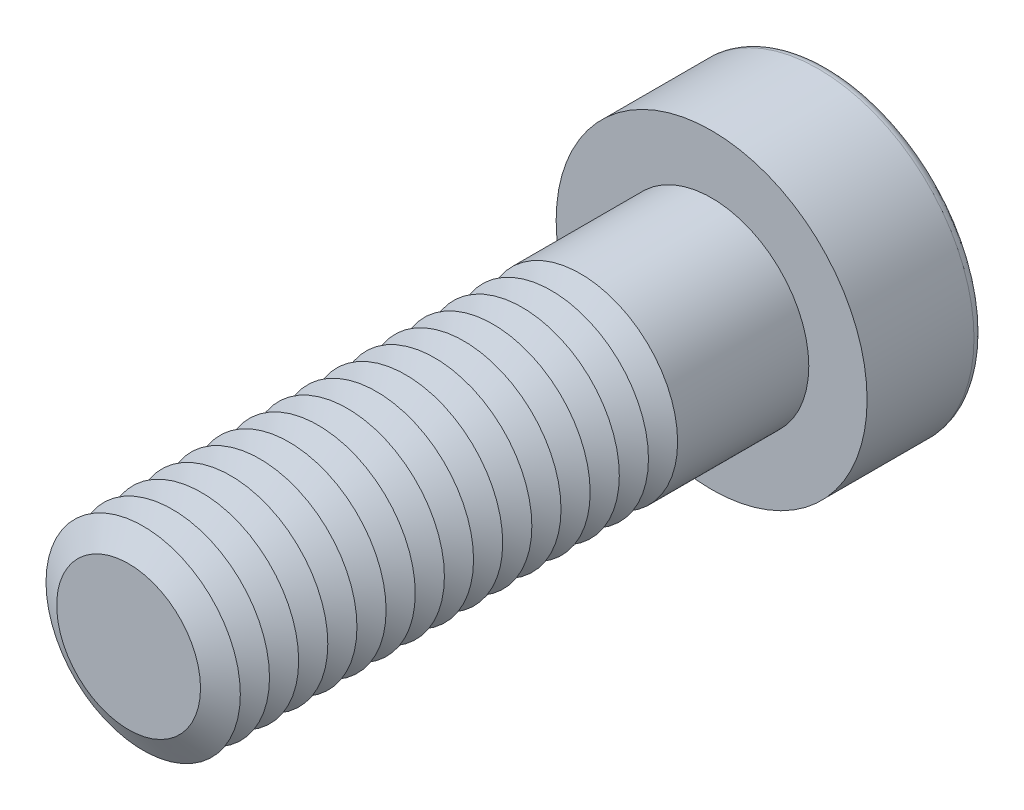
ISO-10303-21;
HEADER;
FILE_DESCRIPTION(('STEP AP214'),'2;1');
FILE_NAME('part.step','',(''),(''),'','','');
FILE_SCHEMA(('AUTOMOTIVE_DESIGN { 1 0 10303 214 1 1 1 1 }'));
ENDSEC;
DATA;
#1=APPLICATION_CONTEXT('core data for automotive mechanical design processes');
#2=APPLICATION_PROTOCOL_DEFINITION('international standard','automotive_design',2000,#1);
#3=PRODUCT_CONTEXT('',#1,'mechanical');
#4=PRODUCT('Part','Part','',(#3));
#5=PRODUCT_RELATED_PRODUCT_CATEGORY('part','',(#4));
#6=PRODUCT_DEFINITION_FORMATION('','',#4);
#7=PRODUCT_DEFINITION_CONTEXT('part definition',#1,'design');
#8=PRODUCT_DEFINITION('design','',#6,#7);
#9=PRODUCT_DEFINITION_SHAPE('','',#8);
#10=(LENGTH_UNIT() NAMED_UNIT(*) SI_UNIT(.MILLI.,.METRE.));
#11=(NAMED_UNIT(*) PLANE_ANGLE_UNIT() SI_UNIT($,.RADIAN.));
#12=(NAMED_UNIT(*) SI_UNIT($,.STERADIAN.) SOLID_ANGLE_UNIT());
#13=UNCERTAINTY_MEASURE_WITH_UNIT(LENGTH_MEASURE(1.E-05),#10,'distance_accuracy_value','');
#14=(GEOMETRIC_REPRESENTATION_CONTEXT(3) GLOBAL_UNCERTAINTY_ASSIGNED_CONTEXT((#13)) GLOBAL_UNIT_ASSIGNED_CONTEXT((#10,
#11,#12)) REPRESENTATION_CONTEXT('',''));
#15=CARTESIAN_POINT('',(0.,0.,0.));
#16=DIRECTION('',(0.,0.,1.));
#17=DIRECTION('',(1.,0.,0.));
#18=AXIS2_PLACEMENT_3D('',#15,#16,#17);
#19=CARTESIAN_POINT('',(0.,0.,24.75));
#20=DIRECTION('',(0.,0.,1.));
#21=DIRECTION('',(1.,0.,0.));
#22=AXIS2_PLACEMENT_3D('',#19,#20,#21);
#23=CONICAL_SURFACE('',#22,5.,1.0471975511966);
#24=CARTESIAN_POINT('',(0.,0.,24.));
#25=DIRECTION('',(0.,0.,1.));
#26=DIRECTION('',(1.,0.,0.));
#27=AXIS2_PLACEMENT_3D('',#24,#25,#26);
#28=CIRCLE('',#27,3.70096189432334);
#29=CARTESIAN_POINT('',(3.70096189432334,0.,24.));
#30=VERTEX_POINT('',#29);
#31=EDGE_CURVE('E313',#30,#30,#28,.T.);
#32=ORIENTED_EDGE('',*,*,#31,.T.);
#33=EDGE_LOOP('',(#32));
#34=FACE_BOUND('',#33,.T.);
#35=CARTESIAN_POINT('',(0.,0.,24.75));
#36=DIRECTION('',(0.,0.,1.));
#37=DIRECTION('',(1.,0.,0.));
#38=AXIS2_PLACEMENT_3D('',#35,#36,#37);
#39=CIRCLE('',#38,5.);
#40=CARTESIAN_POINT('',(5.,0.,24.75));
#41=VERTEX_POINT('',#40);
#42=EDGE_CURVE('E316',#41,#41,#39,.T.);
#43=ORIENTED_EDGE('',*,*,#42,.F.);
#44=EDGE_LOOP('',(#43));
#45=FACE_BOUND('',#44,.T.);
#46=ADVANCED_FACE('F39',(#34,#45),#23,.T.);
#47=CARTESIAN_POINT('',(0.,0.,24.));
#48=DIRECTION('',(0.,0.,-1.));
#49=DIRECTION('',(-1.,0.,0.));
#50=AXIS2_PLACEMENT_3D('',#47,#48,#49);
#51=CONICAL_SURFACE('',#50,3.70096189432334,1.0471975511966);
#52=CARTESIAN_POINT('',(0.,0.,23.25));
#53=DIRECTION('',(0.,0.,1.));
#54=DIRECTION('',(1.,0.,0.));
#55=AXIS2_PLACEMENT_3D('',#52,#53,#54);
#56=CIRCLE('',#55,5.);
#57=CARTESIAN_POINT('',(5.,0.,23.25));
#58=VERTEX_POINT('',#57);
#59=EDGE_CURVE('E324',#58,#58,#56,.T.);
#60=ORIENTED_EDGE('',*,*,#59,.T.);
#61=EDGE_LOOP('',(#60));
#62=FACE_BOUND('',#61,.T.);
#63=ORIENTED_EDGE('',*,*,#31,.F.);
#64=EDGE_LOOP('',(#63));
#65=FACE_BOUND('',#64,.T.);
#66=ADVANCED_FACE('F245',(#62,#65),#51,.T.);
#67=CARTESIAN_POINT('',(0.,0.,30.));
#68=DIRECTION('',(0.,0.,1.));
#69=DIRECTION('',(1.,0.,0.));
#70=AXIS2_PLACEMENT_3D('',#67,#68,#69);
#71=PLANE('',#70);
#72=CARTESIAN_POINT('',(0.,0.,30.));
#73=DIRECTION('',(0.,0.,1.));
#74=DIRECTION('',(1.,0.,0.));
#75=AXIS2_PLACEMENT_3D('',#72,#73,#74);
#76=CIRCLE('',#75,3.70096189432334);
#77=CARTESIAN_POINT('',(3.70096189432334,0.,30.));
#78=VERTEX_POINT('',#77);
#79=EDGE_CURVE('E174',#78,#78,#76,.T.);
#80=ORIENTED_EDGE('',*,*,#79,.T.);
#81=EDGE_LOOP('',(#80));
#82=FACE_BOUND('',#81,.T.);
#83=ADVANCED_FACE('F251',(#82),#71,.T.);
#84=CARTESIAN_POINT('',(0.,0.,30.));
#85=DIRECTION('',(0.,0.,-1.));
#86=DIRECTION('',(-1.,0.,0.));
#87=AXIS2_PLACEMENT_3D('',#84,#85,#86);
#88=CONICAL_SURFACE('',#87,3.70096189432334,1.0471975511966);
#89=CARTESIAN_POINT('',(0.,0.,29.25));
#90=DIRECTION('',(0.,0.,1.));
#91=DIRECTION('',(1.,0.,0.));
#92=AXIS2_PLACEMENT_3D('',#89,#90,#91);
#93=CIRCLE('',#92,5.);
#94=CARTESIAN_POINT('',(5.,0.,29.25));
#95=VERTEX_POINT('',#94);
#96=EDGE_CURVE('E291',#95,#95,#93,.T.);
#97=ORIENTED_EDGE('',*,*,#96,.T.);
#98=EDGE_LOOP('',(#97));
#99=FACE_BOUND('',#98,.T.);
#100=ORIENTED_EDGE('',*,*,#79,.F.);
#101=EDGE_LOOP('',(#100));
#102=FACE_BOUND('',#101,.T.);
#103=ADVANCED_FACE('F199',(#99,#102),#88,.T.);
#104=CARTESIAN_POINT('',(0.,0.,29.25));
#105=DIRECTION('',(0.,0.,1.));
#106=DIRECTION('',(1.,0.,0.));
#107=AXIS2_PLACEMENT_3D('',#104,#105,#106);
#108=CONICAL_SURFACE('',#107,5.,1.0471975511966);
#109=CARTESIAN_POINT('',(0.,0.,28.5));
#110=DIRECTION('',(0.,0.,1.));
#111=DIRECTION('',(1.,0.,0.));
#112=AXIS2_PLACEMENT_3D('',#109,#110,#111);
#113=CIRCLE('',#112,3.70096189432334);
#114=CARTESIAN_POINT('',(3.70096189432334,0.,28.5));
#115=VERTEX_POINT('',#114);
#116=EDGE_CURVE('E288',#115,#115,#113,.T.);
#117=ORIENTED_EDGE('',*,*,#116,.T.);
#118=EDGE_LOOP('',(#117));
#119=FACE_BOUND('',#118,.T.);
#120=ORIENTED_EDGE('',*,*,#96,.F.);
#121=EDGE_LOOP('',(#120));
#122=FACE_BOUND('',#121,.T.);
#123=ADVANCED_FACE('F277',(#119,#122),#108,.T.);
#124=CARTESIAN_POINT('',(0.,0.,28.5));
#125=DIRECTION('',(0.,0.,-1.));
#126=DIRECTION('',(-1.,0.,0.));
#127=AXIS2_PLACEMENT_3D('',#124,#125,#126);
#128=CONICAL_SURFACE('',#127,3.70096189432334,1.0471975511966);
#129=CARTESIAN_POINT('',(0.,0.,27.75));
#130=DIRECTION('',(0.,0.,1.));
#131=DIRECTION('',(1.,0.,0.));
#132=AXIS2_PLACEMENT_3D('',#129,#130,#131);
#133=CIRCLE('',#132,5.);
#134=CARTESIAN_POINT('',(5.,0.,27.75));
#135=VERTEX_POINT('',#134);
#136=EDGE_CURVE('E299',#135,#135,#133,.T.);
#137=ORIENTED_EDGE('',*,*,#136,.T.);
#138=EDGE_LOOP('',(#137));
#139=FACE_BOUND('',#138,.T.);
#140=ORIENTED_EDGE('',*,*,#116,.F.);
#141=EDGE_LOOP('',(#140));
#142=FACE_BOUND('',#141,.T.);
#143=ADVANCED_FACE('F274',(#139,#142),#128,.T.);
#144=CARTESIAN_POINT('',(0.,0.,27.75));
#145=DIRECTION('',(0.,0.,1.));
#146=DIRECTION('',(1.,0.,0.));
#147=AXIS2_PLACEMENT_3D('',#144,#145,#146);
#148=CONICAL_SURFACE('',#147,5.,1.0471975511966);
#149=CARTESIAN_POINT('',(0.,0.,27.));
#150=DIRECTION('',(0.,0.,1.));
#151=DIRECTION('',(1.,0.,0.));
#152=AXIS2_PLACEMENT_3D('',#149,#150,#151);
#153=CIRCLE('',#152,3.70096189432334);
#154=CARTESIAN_POINT('',(3.70096189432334,0.,27.));
#155=VERTEX_POINT('',#154);
#156=EDGE_CURVE('E293',#155,#155,#153,.T.);
#157=ORIENTED_EDGE('',*,*,#156,.T.);
#158=EDGE_LOOP('',(#157));
#159=FACE_BOUND('',#158,.T.);
#160=ORIENTED_EDGE('',*,*,#136,.F.);
#161=EDGE_LOOP('',(#160));
#162=FACE_BOUND('',#161,.T.);
#163=ADVANCED_FACE('F270',(#159,#162),#148,.T.);
#164=CARTESIAN_POINT('',(0.,0.,27.));
#165=DIRECTION('',(0.,0.,-1.));
#166=DIRECTION('',(-1.,0.,0.));
#167=AXIS2_PLACEMENT_3D('',#164,#165,#166);
#168=CONICAL_SURFACE('',#167,3.70096189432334,1.0471975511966);
#169=CARTESIAN_POINT('',(0.,0.,26.25));
#170=DIRECTION('',(0.,0.,1.));
#171=DIRECTION('',(1.,0.,0.));
#172=AXIS2_PLACEMENT_3D('',#169,#170,#171);
#173=CIRCLE('',#172,5.);
#174=CARTESIAN_POINT('',(5.,0.,26.25));
#175=VERTEX_POINT('',#174);
#176=EDGE_CURVE('E309',#175,#175,#173,.T.);
#177=ORIENTED_EDGE('',*,*,#176,.T.);
#178=EDGE_LOOP('',(#177));
#179=FACE_BOUND('',#178,.T.);
#180=ORIENTED_EDGE('',*,*,#156,.F.);
#181=EDGE_LOOP('',(#180));
#182=FACE_BOUND('',#181,.T.);
#183=ADVANCED_FACE('F266',(#179,#182),#168,.T.);
#184=CARTESIAN_POINT('',(0.,0.,26.25));
#185=DIRECTION('',(0.,0.,1.));
#186=DIRECTION('',(1.,0.,0.));
#187=AXIS2_PLACEMENT_3D('',#184,#185,#186);
#188=CONICAL_SURFACE('',#187,5.,1.0471975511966);
#189=CARTESIAN_POINT('',(0.,0.,25.5));
#190=DIRECTION('',(0.,0.,1.));
#191=DIRECTION('',(1.,0.,0.));
#192=AXIS2_PLACEMENT_3D('',#189,#190,#191);
#193=CIRCLE('',#192,3.70096189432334);
#194=CARTESIAN_POINT('',(3.70096189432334,0.,25.5));
#195=VERTEX_POINT('',#194);
#196=EDGE_CURVE('E305',#195,#195,#193,.T.);
#197=ORIENTED_EDGE('',*,*,#196,.T.);
#198=EDGE_LOOP('',(#197));
#199=FACE_BOUND('',#198,.T.);
#200=ORIENTED_EDGE('',*,*,#176,.F.);
#201=EDGE_LOOP('',(#200));
#202=FACE_BOUND('',#201,.T.);
#203=ADVANCED_FACE('F262',(#199,#202),#188,.T.);
#204=CARTESIAN_POINT('',(0.,0.,25.5));
#205=DIRECTION('',(0.,0.,-1.));
#206=DIRECTION('',(-1.,0.,0.));
#207=AXIS2_PLACEMENT_3D('',#204,#205,#206);
#208=CONICAL_SURFACE('',#207,3.70096189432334,1.0471975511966);
#209=ORIENTED_EDGE('',*,*,#42,.T.);
#210=EDGE_LOOP('',(#209));
#211=FACE_BOUND('',#210,.T.);
#212=ORIENTED_EDGE('',*,*,#196,.F.);
#213=EDGE_LOOP('',(#212));
#214=FACE_BOUND('',#213,.T.);
#215=ADVANCED_FACE('F258',(#211,#214),#208,.T.);
#216=CARTESIAN_POINT('',(0.,0.,23.25));
#217=DIRECTION('',(0.,0.,1.));
#218=DIRECTION('',(1.,0.,0.));
#219=AXIS2_PLACEMENT_3D('',#216,#217,#218);
#220=CONICAL_SURFACE('',#219,5.,1.0471975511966);
#221=CARTESIAN_POINT('',(0.,0.,22.5));
#222=DIRECTION('',(0.,0.,1.));
#223=DIRECTION('',(1.,0.,0.));
#224=AXIS2_PLACEMENT_3D('',#221,#222,#223);
#225=CIRCLE('',#224,3.70096189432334);
#226=CARTESIAN_POINT('',(3.70096189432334,0.,22.5));
#227=VERTEX_POINT('',#226);
#228=EDGE_CURVE('E320',#227,#227,#225,.T.);
#229=ORIENTED_EDGE('',*,*,#228,.T.);
#230=EDGE_LOOP('',(#229));
#231=FACE_BOUND('',#230,.T.);
#232=ORIENTED_EDGE('',*,*,#59,.F.);
#233=EDGE_LOOP('',(#232));
#234=FACE_BOUND('',#233,.T.);
#235=ADVANCED_FACE('F261',(#231,#234),#220,.T.);
#236=CARTESIAN_POINT('',(0.,0.,22.5));
#237=DIRECTION('',(0.,0.,-1.));
#238=DIRECTION('',(-1.,0.,0.));
#239=AXIS2_PLACEMENT_3D('',#236,#237,#238);
#240=CONICAL_SURFACE('',#239,3.70096189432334,1.0471975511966);
#241=CARTESIAN_POINT('',(0.,0.,21.75));
#242=DIRECTION('',(0.,0.,1.));
#243=DIRECTION('',(1.,0.,0.));
#244=AXIS2_PLACEMENT_3D('',#241,#242,#243);
#245=CIRCLE('',#244,5.);
#246=CARTESIAN_POINT('',(5.,0.,21.75));
#247=VERTEX_POINT('',#246);
#248=EDGE_CURVE('E331',#247,#247,#245,.T.);
#249=ORIENTED_EDGE('',*,*,#248,.T.);
#250=EDGE_LOOP('',(#249));
#251=FACE_BOUND('',#250,.T.);
#252=ORIENTED_EDGE('',*,*,#228,.F.);
#253=EDGE_LOOP('',(#252));
#254=FACE_BOUND('',#253,.T.);
#255=ADVANCED_FACE('F496',(#251,#254),#240,.T.);
#256=CARTESIAN_POINT('',(0.,0.,21.75));
#257=DIRECTION('',(0.,0.,1.));
#258=DIRECTION('',(1.,0.,0.));
#259=AXIS2_PLACEMENT_3D('',#256,#257,#258);
#260=CONICAL_SURFACE('',#259,5.,1.0471975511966);
#261=CARTESIAN_POINT('',(0.,0.,21.));
#262=DIRECTION('',(0.,0.,1.));
#263=DIRECTION('',(1.,0.,0.));
#264=AXIS2_PLACEMENT_3D('',#261,#262,#263);
#265=CIRCLE('',#264,3.70096189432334);
#266=CARTESIAN_POINT('',(3.70096189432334,0.,21.));
#267=VERTEX_POINT('',#266);
#268=EDGE_CURVE('E327',#267,#267,#265,.T.);
#269=ORIENTED_EDGE('',*,*,#268,.T.);
#270=EDGE_LOOP('',(#269));
#271=FACE_BOUND('',#270,.T.);
#272=ORIENTED_EDGE('',*,*,#248,.F.);
#273=EDGE_LOOP('',(#272));
#274=FACE_BOUND('',#273,.T.);
#275=ADVANCED_FACE('F492',(#271,#274),#260,.T.);
#276=CARTESIAN_POINT('',(0.,0.,21.));
#277=DIRECTION('',(0.,0.,-1.));
#278=DIRECTION('',(-1.,0.,0.));
#279=AXIS2_PLACEMENT_3D('',#276,#277,#278);
#280=CONICAL_SURFACE('',#279,3.70096189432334,1.0471975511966);
#281=CARTESIAN_POINT('',(0.,0.,20.25));
#282=DIRECTION('',(0.,0.,1.));
#283=DIRECTION('',(1.,0.,0.));
#284=AXIS2_PLACEMENT_3D('',#281,#282,#283);
#285=CIRCLE('',#284,5.);
#286=CARTESIAN_POINT('',(5.,0.,20.25));
#287=VERTEX_POINT('',#286);
#288=EDGE_CURVE('E339',#287,#287,#285,.T.);
#289=ORIENTED_EDGE('',*,*,#288,.T.);
#290=EDGE_LOOP('',(#289));
#291=FACE_BOUND('',#290,.T.);
#292=ORIENTED_EDGE('',*,*,#268,.F.);
#293=EDGE_LOOP('',(#292));
#294=FACE_BOUND('',#293,.T.);
#295=ADVANCED_FACE('F488',(#291,#294),#280,.T.);
#296=CARTESIAN_POINT('',(0.,0.,20.25));
#297=DIRECTION('',(0.,0.,1.));
#298=DIRECTION('',(1.,0.,0.));
#299=AXIS2_PLACEMENT_3D('',#296,#297,#298);
#300=CONICAL_SURFACE('',#299,5.,1.0471975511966);
#301=CARTESIAN_POINT('',(0.,0.,19.5));
#302=DIRECTION('',(0.,0.,1.));
#303=DIRECTION('',(1.,0.,0.));
#304=AXIS2_PLACEMENT_3D('',#301,#302,#303);
#305=CIRCLE('',#304,3.70096189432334);
#306=CARTESIAN_POINT('',(3.70096189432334,0.,19.5));
#307=VERTEX_POINT('',#306);
#308=EDGE_CURVE('E335',#307,#307,#305,.T.);
#309=ORIENTED_EDGE('',*,*,#308,.T.);
#310=EDGE_LOOP('',(#309));
#311=FACE_BOUND('',#310,.T.);
#312=ORIENTED_EDGE('',*,*,#288,.F.);
#313=EDGE_LOOP('',(#312));
#314=FACE_BOUND('',#313,.T.);
#315=ADVANCED_FACE('F484',(#311,#314),#300,.T.);
#316=CARTESIAN_POINT('',(0.,0.,19.5));
#317=DIRECTION('',(0.,0.,-1.));
#318=DIRECTION('',(-1.,0.,0.));
#319=AXIS2_PLACEMENT_3D('',#316,#317,#318);
#320=CONICAL_SURFACE('',#319,3.70096189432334,1.0471975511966);
#321=CARTESIAN_POINT('',(0.,0.,18.75));
#322=DIRECTION('',(0.,0.,1.));
#323=DIRECTION('',(1.,0.,0.));
#324=AXIS2_PLACEMENT_3D('',#321,#322,#323);
#325=CIRCLE('',#324,5.);
#326=CARTESIAN_POINT('',(5.,0.,18.75));
#327=VERTEX_POINT('',#326);
#328=EDGE_CURVE('E347',#327,#327,#325,.T.);
#329=ORIENTED_EDGE('',*,*,#328,.T.);
#330=EDGE_LOOP('',(#329));
#331=FACE_BOUND('',#330,.T.);
#332=ORIENTED_EDGE('',*,*,#308,.F.);
#333=EDGE_LOOP('',(#332));
#334=FACE_BOUND('',#333,.T.);
#335=ADVANCED_FACE('F480',(#331,#334),#320,.T.);
#336=CARTESIAN_POINT('',(0.,0.,18.75));
#337=DIRECTION('',(0.,0.,1.));
#338=DIRECTION('',(1.,0.,0.));
#339=AXIS2_PLACEMENT_3D('',#336,#337,#338);
#340=CONICAL_SURFACE('',#339,5.,1.0471975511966);
#341=CARTESIAN_POINT('',(0.,0.,18.));
#342=DIRECTION('',(0.,0.,1.));
#343=DIRECTION('',(1.,0.,0.));
#344=AXIS2_PLACEMENT_3D('',#341,#342,#343);
#345=CIRCLE('',#344,3.70096189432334);
#346=CARTESIAN_POINT('',(3.70096189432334,0.,18.));
#347=VERTEX_POINT('',#346);
#348=EDGE_CURVE('E343',#347,#347,#345,.T.);
#349=ORIENTED_EDGE('',*,*,#348,.T.);
#350=EDGE_LOOP('',(#349));
#351=FACE_BOUND('',#350,.T.);
#352=ORIENTED_EDGE('',*,*,#328,.F.);
#353=EDGE_LOOP('',(#352));
#354=FACE_BOUND('',#353,.T.);
#355=ADVANCED_FACE('F476',(#351,#354),#340,.T.);
#356=CARTESIAN_POINT('',(0.,0.,18.));
#357=DIRECTION('',(0.,0.,-1.));
#358=DIRECTION('',(-1.,0.,0.));
#359=AXIS2_PLACEMENT_3D('',#356,#357,#358);
#360=CONICAL_SURFACE('',#359,3.70096189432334,1.0471975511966);
#361=CARTESIAN_POINT('',(0.,0.,17.25));
#362=DIRECTION('',(0.,0.,1.));
#363=DIRECTION('',(1.,0.,0.));
#364=AXIS2_PLACEMENT_3D('',#361,#362,#363);
#365=CIRCLE('',#364,5.);
#366=CARTESIAN_POINT('',(5.,0.,17.25));
#367=VERTEX_POINT('',#366);
#368=EDGE_CURVE('E355',#367,#367,#365,.T.);
#369=ORIENTED_EDGE('',*,*,#368,.T.);
#370=EDGE_LOOP('',(#369));
#371=FACE_BOUND('',#370,.T.);
#372=ORIENTED_EDGE('',*,*,#348,.F.);
#373=EDGE_LOOP('',(#372));
#374=FACE_BOUND('',#373,.T.);
#375=ADVANCED_FACE('F472',(#371,#374),#360,.T.);
#376=CARTESIAN_POINT('',(0.,0.,17.25));
#377=DIRECTION('',(0.,0.,1.));
#378=DIRECTION('',(1.,0.,0.));
#379=AXIS2_PLACEMENT_3D('',#376,#377,#378);
#380=CONICAL_SURFACE('',#379,5.,1.0471975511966);
#381=CARTESIAN_POINT('',(0.,0.,16.5));
#382=DIRECTION('',(0.,0.,1.));
#383=DIRECTION('',(1.,0.,0.));
#384=AXIS2_PLACEMENT_3D('',#381,#382,#383);
#385=CIRCLE('',#384,3.70096189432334);
#386=CARTESIAN_POINT('',(3.70096189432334,0.,16.5));
#387=VERTEX_POINT('',#386);
#388=EDGE_CURVE('E351',#387,#387,#385,.T.);
#389=ORIENTED_EDGE('',*,*,#388,.T.);
#390=EDGE_LOOP('',(#389));
#391=FACE_BOUND('',#390,.T.);
#392=ORIENTED_EDGE('',*,*,#368,.F.);
#393=EDGE_LOOP('',(#392));
#394=FACE_BOUND('',#393,.T.);
#395=ADVANCED_FACE('F468',(#391,#394),#380,.T.);
#396=CARTESIAN_POINT('',(0.,0.,16.5));
#397=DIRECTION('',(0.,0.,-1.));
#398=DIRECTION('',(-1.,0.,0.));
#399=AXIS2_PLACEMENT_3D('',#396,#397,#398);
#400=CONICAL_SURFACE('',#399,3.70096189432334,1.0471975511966);
#401=CARTESIAN_POINT('',(0.,0.,15.75));
#402=DIRECTION('',(0.,0.,1.));
#403=DIRECTION('',(1.,0.,0.));
#404=AXIS2_PLACEMENT_3D('',#401,#402,#403);
#405=CIRCLE('',#404,5.);
#406=CARTESIAN_POINT('',(5.,0.,15.75));
#407=VERTEX_POINT('',#406);
#408=EDGE_CURVE('E363',#407,#407,#405,.T.);
#409=ORIENTED_EDGE('',*,*,#408,.T.);
#410=EDGE_LOOP('',(#409));
#411=FACE_BOUND('',#410,.T.);
#412=ORIENTED_EDGE('',*,*,#388,.F.);
#413=EDGE_LOOP('',(#412));
#414=FACE_BOUND('',#413,.T.);
#415=ADVANCED_FACE('F464',(#411,#414),#400,.T.);
#416=CARTESIAN_POINT('',(0.,0.,15.75));
#417=DIRECTION('',(0.,0.,1.));
#418=DIRECTION('',(1.,0.,0.));
#419=AXIS2_PLACEMENT_3D('',#416,#417,#418);
#420=CONICAL_SURFACE('',#419,5.,1.0471975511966);
#421=CARTESIAN_POINT('',(0.,0.,15.));
#422=DIRECTION('',(0.,0.,1.));
#423=DIRECTION('',(1.,0.,0.));
#424=AXIS2_PLACEMENT_3D('',#421,#422,#423);
#425=CIRCLE('',#424,3.70096189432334);
#426=CARTESIAN_POINT('',(3.70096189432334,0.,15.));
#427=VERTEX_POINT('',#426);
#428=EDGE_CURVE('E359',#427,#427,#425,.T.);
#429=ORIENTED_EDGE('',*,*,#428,.T.);
#430=EDGE_LOOP('',(#429));
#431=FACE_BOUND('',#430,.T.);
#432=ORIENTED_EDGE('',*,*,#408,.F.);
#433=EDGE_LOOP('',(#432));
#434=FACE_BOUND('',#433,.T.);
#435=ADVANCED_FACE('F460',(#431,#434),#420,.T.);
#436=CARTESIAN_POINT('',(0.,0.,15.));
#437=DIRECTION('',(0.,0.,-1.));
#438=DIRECTION('',(-1.,0.,0.));
#439=AXIS2_PLACEMENT_3D('',#436,#437,#438);
#440=CONICAL_SURFACE('',#439,3.70096189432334,1.0471975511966);
#441=CARTESIAN_POINT('',(0.,0.,14.25));
#442=DIRECTION('',(0.,0.,1.));
#443=DIRECTION('',(1.,0.,0.));
#444=AXIS2_PLACEMENT_3D('',#441,#442,#443);
#445=CIRCLE('',#444,5.);
#446=CARTESIAN_POINT('',(5.,0.,14.25));
#447=VERTEX_POINT('',#446);
#448=EDGE_CURVE('E371',#447,#447,#445,.T.);
#449=ORIENTED_EDGE('',*,*,#448,.T.);
#450=EDGE_LOOP('',(#449));
#451=FACE_BOUND('',#450,.T.);
#452=ORIENTED_EDGE('',*,*,#428,.F.);
#453=EDGE_LOOP('',(#452));
#454=FACE_BOUND('',#453,.T.);
#455=ADVANCED_FACE('F456',(#451,#454),#440,.T.);
#456=CARTESIAN_POINT('',(0.,0.,14.25));
#457=DIRECTION('',(0.,0.,1.));
#458=DIRECTION('',(1.,0.,0.));
#459=AXIS2_PLACEMENT_3D('',#456,#457,#458);
#460=CONICAL_SURFACE('',#459,5.,1.0471975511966);
#461=CARTESIAN_POINT('',(0.,0.,13.5));
#462=DIRECTION('',(0.,0.,1.));
#463=DIRECTION('',(1.,0.,0.));
#464=AXIS2_PLACEMENT_3D('',#461,#462,#463);
#465=CIRCLE('',#464,3.70096189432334);
#466=CARTESIAN_POINT('',(3.70096189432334,0.,13.5));
#467=VERTEX_POINT('',#466);
#468=EDGE_CURVE('E367',#467,#467,#465,.T.);
#469=ORIENTED_EDGE('',*,*,#468,.T.);
#470=EDGE_LOOP('',(#469));
#471=FACE_BOUND('',#470,.T.);
#472=ORIENTED_EDGE('',*,*,#448,.F.);
#473=EDGE_LOOP('',(#472));
#474=FACE_BOUND('',#473,.T.);
#475=ADVANCED_FACE('F452',(#471,#474),#460,.T.);
#476=CARTESIAN_POINT('',(0.,0.,13.5));
#477=DIRECTION('',(0.,0.,-1.));
#478=DIRECTION('',(-1.,0.,0.));
#479=AXIS2_PLACEMENT_3D('',#476,#477,#478);
#480=CONICAL_SURFACE('',#479,3.70096189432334,1.0471975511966);
#481=CARTESIAN_POINT('',(0.,0.,12.75));
#482=DIRECTION('',(0.,0.,1.));
#483=DIRECTION('',(1.,0.,0.));
#484=AXIS2_PLACEMENT_3D('',#481,#482,#483);
#485=CIRCLE('',#484,5.);
#486=CARTESIAN_POINT('',(5.,0.,12.75));
#487=VERTEX_POINT('',#486);
#488=EDGE_CURVE('E379',#487,#487,#485,.T.);
#489=ORIENTED_EDGE('',*,*,#488,.T.);
#490=EDGE_LOOP('',(#489));
#491=FACE_BOUND('',#490,.T.);
#492=ORIENTED_EDGE('',*,*,#468,.F.);
#493=EDGE_LOOP('',(#492));
#494=FACE_BOUND('',#493,.T.);
#495=ADVANCED_FACE('F448',(#491,#494),#480,.T.);
#496=CARTESIAN_POINT('',(0.,0.,12.75));
#497=DIRECTION('',(0.,0.,1.));
#498=DIRECTION('',(1.,0.,0.));
#499=AXIS2_PLACEMENT_3D('',#496,#497,#498);
#500=CONICAL_SURFACE('',#499,5.,1.0471975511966);
#501=CARTESIAN_POINT('',(0.,0.,12.));
#502=DIRECTION('',(0.,0.,1.));
#503=DIRECTION('',(1.,0.,0.));
#504=AXIS2_PLACEMENT_3D('',#501,#502,#503);
#505=CIRCLE('',#504,3.70096189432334);
#506=CARTESIAN_POINT('',(3.70096189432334,0.,12.));
#507=VERTEX_POINT('',#506);
#508=EDGE_CURVE('E375',#507,#507,#505,.T.);
#509=ORIENTED_EDGE('',*,*,#508,.T.);
#510=EDGE_LOOP('',(#509));
#511=FACE_BOUND('',#510,.T.);
#512=ORIENTED_EDGE('',*,*,#488,.F.);
#513=EDGE_LOOP('',(#512));
#514=FACE_BOUND('',#513,.T.);
#515=ADVANCED_FACE('F444',(#511,#514),#500,.T.);
#516=CARTESIAN_POINT('',(0.,0.,12.));
#517=DIRECTION('',(0.,0.,-1.));
#518=DIRECTION('',(-1.,0.,0.));
#519=AXIS2_PLACEMENT_3D('',#516,#517,#518);
#520=CONICAL_SURFACE('',#519,3.70096189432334,1.0471975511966);
#521=CARTESIAN_POINT('',(0.,0.,11.25));
#522=DIRECTION('',(0.,0.,1.));
#523=DIRECTION('',(1.,0.,0.));
#524=AXIS2_PLACEMENT_3D('',#521,#522,#523);
#525=CIRCLE('',#524,5.);
#526=CARTESIAN_POINT('',(5.,0.,11.25));
#527=VERTEX_POINT('',#526);
#528=EDGE_CURVE('E387',#527,#527,#525,.T.);
#529=ORIENTED_EDGE('',*,*,#528,.T.);
#530=EDGE_LOOP('',(#529));
#531=FACE_BOUND('',#530,.T.);
#532=ORIENTED_EDGE('',*,*,#508,.F.);
#533=EDGE_LOOP('',(#532));
#534=FACE_BOUND('',#533,.T.);
#535=ADVANCED_FACE('F440',(#531,#534),#520,.T.);
#536=CARTESIAN_POINT('',(0.,0.,11.25));
#537=DIRECTION('',(0.,0.,1.));
#538=DIRECTION('',(1.,0.,0.));
#539=AXIS2_PLACEMENT_3D('',#536,#537,#538);
#540=CONICAL_SURFACE('',#539,5.,1.0471975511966);
#541=CARTESIAN_POINT('',(0.,0.,10.5));
#542=DIRECTION('',(0.,0.,1.));
#543=DIRECTION('',(1.,0.,0.));
#544=AXIS2_PLACEMENT_3D('',#541,#542,#543);
#545=CIRCLE('',#544,3.70096189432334);
#546=CARTESIAN_POINT('',(3.70096189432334,0.,10.5));
#547=VERTEX_POINT('',#546);
#548=EDGE_CURVE('E383',#547,#547,#545,.T.);
#549=ORIENTED_EDGE('',*,*,#548,.T.);
#550=EDGE_LOOP('',(#549));
#551=FACE_BOUND('',#550,.T.);
#552=ORIENTED_EDGE('',*,*,#528,.F.);
#553=EDGE_LOOP('',(#552));
#554=FACE_BOUND('',#553,.T.);
#555=ADVANCED_FACE('F436',(#551,#554),#540,.T.);
#556=CARTESIAN_POINT('',(0.,0.,10.5));
#557=DIRECTION('',(0.,0.,-1.));
#558=DIRECTION('',(-1.,0.,0.));
#559=AXIS2_PLACEMENT_3D('',#556,#557,#558);
#560=CONICAL_SURFACE('',#559,3.70096189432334,1.0471975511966);
#561=CARTESIAN_POINT('',(0.,0.,9.75));
#562=DIRECTION('',(0.,0.,1.));
#563=DIRECTION('',(1.,0.,0.));
#564=AXIS2_PLACEMENT_3D('',#561,#562,#563);
#565=CIRCLE('',#564,5.);
#566=CARTESIAN_POINT('',(5.,0.,9.75));
#567=VERTEX_POINT('',#566);
#568=EDGE_CURVE('E395',#567,#567,#565,.T.);
#569=ORIENTED_EDGE('',*,*,#568,.T.);
#570=EDGE_LOOP('',(#569));
#571=FACE_BOUND('',#570,.T.);
#572=ORIENTED_EDGE('',*,*,#548,.F.);
#573=EDGE_LOOP('',(#572));
#574=FACE_BOUND('',#573,.T.);
#575=ADVANCED_FACE('F432',(#571,#574),#560,.T.);
#576=CARTESIAN_POINT('',(0.,0.,9.75));
#577=DIRECTION('',(0.,0.,1.));
#578=DIRECTION('',(1.,0.,0.));
#579=AXIS2_PLACEMENT_3D('',#576,#577,#578);
#580=CONICAL_SURFACE('',#579,5.,1.0471975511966);
#581=CARTESIAN_POINT('',(0.,0.,9.));
#582=DIRECTION('',(0.,0.,1.));
#583=DIRECTION('',(1.,0.,0.));
#584=AXIS2_PLACEMENT_3D('',#581,#582,#583);
#585=CIRCLE('',#584,3.70096189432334);
#586=CARTESIAN_POINT('',(3.70096189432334,0.,9.));
#587=VERTEX_POINT('',#586);
#588=EDGE_CURVE('E391',#587,#587,#585,.T.);
#589=ORIENTED_EDGE('',*,*,#588,.T.);
#590=EDGE_LOOP('',(#589));
#591=FACE_BOUND('',#590,.T.);
#592=ORIENTED_EDGE('',*,*,#568,.F.);
#593=EDGE_LOOP('',(#592));
#594=FACE_BOUND('',#593,.T.);
#595=ADVANCED_FACE('F427',(#591,#594),#580,.T.);
#596=CARTESIAN_POINT('',(0.,0.,9.));
#597=DIRECTION('',(0.,0.,-1.));
#598=DIRECTION('',(-1.,0.,0.));
#599=AXIS2_PLACEMENT_3D('',#596,#597,#598);
#600=CONICAL_SURFACE('',#599,3.70096189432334,1.0471975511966);
#601=CARTESIAN_POINT('',(0.,0.,8.25));
#602=DIRECTION('',(0.,0.,1.));
#603=DIRECTION('',(1.,0.,0.));
#604=AXIS2_PLACEMENT_3D('',#601,#602,#603);
#605=CIRCLE('',#604,5.);
#606=CARTESIAN_POINT('',(5.,0.,8.25));
#607=VERTEX_POINT('',#606);
#608=EDGE_CURVE('E407',#607,#607,#605,.T.);
#609=ORIENTED_EDGE('',*,*,#608,.T.);
#610=EDGE_LOOP('',(#609));
#611=FACE_BOUND('',#610,.T.);
#612=ORIENTED_EDGE('',*,*,#588,.F.);
#613=EDGE_LOOP('',(#612));
#614=FACE_BOUND('',#613,.T.);
#615=ADVANCED_FACE('F413',(#611,#614),#600,.T.);
#616=CARTESIAN_POINT('',(0.,0.,8.25));
#617=DIRECTION('',(0.,0.,1.));
#618=DIRECTION('',(1.,0.,0.));
#619=AXIS2_PLACEMENT_3D('',#616,#617,#618);
#620=CONICAL_SURFACE('',#619,5.,1.0471975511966);
#621=CARTESIAN_POINT('',(0.,0.,7.5));
#622=DIRECTION('',(0.,0.,1.));
#623=DIRECTION('',(1.,0.,0.));
#624=AXIS2_PLACEMENT_3D('',#621,#622,#623);
#625=CIRCLE('',#624,3.70096189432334);
#626=CARTESIAN_POINT('',(3.70096189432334,0.,7.5));
#627=VERTEX_POINT('',#626);
#628=EDGE_CURVE('E399',#627,#627,#625,.T.);
#629=ORIENTED_EDGE('',*,*,#628,.T.);
#630=EDGE_LOOP('',(#629));
#631=FACE_BOUND('',#630,.T.);
#632=ORIENTED_EDGE('',*,*,#608,.F.);
#633=EDGE_LOOP('',(#632));
#634=FACE_BOUND('',#633,.T.);
#635=ADVANCED_FACE('F416',(#631,#634),#620,.T.);
#636=CARTESIAN_POINT('',(0.,0.,7.5));
#637=DIRECTION('',(0.,0.,-1.));
#638=DIRECTION('',(-1.,0.,0.));
#639=AXIS2_PLACEMENT_3D('',#636,#637,#638);
#640=CONICAL_SURFACE('',#639,3.70096189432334,1.0471975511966);
#641=CARTESIAN_POINT('',(0.,0.,6.75));
#642=DIRECTION('',(0.,0.,1.));
#643=DIRECTION('',(1.,0.,0.));
#644=AXIS2_PLACEMENT_3D('',#641,#642,#643);
#645=CIRCLE('',#644,5.);
#646=CARTESIAN_POINT('',(5.,0.,6.75));
#647=VERTEX_POINT('',#646);
#648=EDGE_CURVE('E403',#647,#647,#645,.T.);
#649=ORIENTED_EDGE('',*,*,#648,.T.);
#650=EDGE_LOOP('',(#649));
#651=FACE_BOUND('',#650,.T.);
#652=ORIENTED_EDGE('',*,*,#628,.F.);
#653=EDGE_LOOP('',(#652));
#654=FACE_BOUND('',#653,.T.);
#655=ADVANCED_FACE('F418',(#651,#654),#640,.T.);
#656=CARTESIAN_POINT('',(0.,0.,-0.75));
#657=DIRECTION('',(0.,0.,-1.));
#658=DIRECTION('',(-1.,0.,0.));
#659=AXIS2_PLACEMENT_3D('',#656,#657,#658);
#660=CONICAL_SURFACE('',#659,3.5,1.0471975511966);
#661=CARTESIAN_POINT('',(0.,0.,1.27072594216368));
#662=VERTEX_POINT('',#661);
#663=VERTEX_LOOP('',#662);
#664=FACE_BOUND('',#663,.T.);
#665=CARTESIAN_POINT('',(0.,0.,-0.75));
#666=DIRECTION('',(0.,0.,-1.));
#667=DIRECTION('',(-1.,0.,0.));
#668=AXIS2_PLACEMENT_3D('',#665,#666,#667);
#669=CIRCLE('',#668,3.5);
#670=CARTESIAN_POINT('',(-3.03108891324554,1.75,-0.75));
#671=VERTEX_POINT('',#670);
#672=CARTESIAN_POINT('',(0.,3.5,-0.75));
#673=VERTEX_POINT('',#672);
#674=EDGE_CURVE('E149',#671,#673,#669,.T.);
#675=ORIENTED_EDGE('',*,*,#674,.T.);
#676=CARTESIAN_POINT('',(0.,0.,-0.75));
#677=DIRECTION('',(0.,0.,-1.));
#678=DIRECTION('',(-1.,0.,0.));
#679=AXIS2_PLACEMENT_3D('',#676,#677,#678);
#680=CIRCLE('',#679,3.5);
#681=CARTESIAN_POINT('',(3.03108891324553,1.75,-0.75));
#682=VERTEX_POINT('',#681);
#683=EDGE_CURVE('E54',#673,#682,#680,.T.);
#684=ORIENTED_EDGE('',*,*,#683,.T.);
#685=CARTESIAN_POINT('',(3.03108891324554,-1.75,-0.75));
#686=VERTEX_POINT('',#685);
#687=EDGE_CURVE('E996',#682,#686,#680,.T.);
#688=ORIENTED_EDGE('',*,*,#687,.T.);
#689=CARTESIAN_POINT('',(0.,-3.5,-0.75));
#690=VERTEX_POINT('',#689);
#691=EDGE_CURVE('E994',#686,#690,#680,.T.);
#692=ORIENTED_EDGE('',*,*,#691,.T.);
#693=CARTESIAN_POINT('',(-3.03108891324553,-1.75,-0.75));
#694=VERTEX_POINT('',#693);
#695=EDGE_CURVE('E989',#690,#694,#680,.T.);
#696=ORIENTED_EDGE('',*,*,#695,.T.);
#697=EDGE_CURVE('E987',#694,#671,#680,.T.);
#698=ORIENTED_EDGE('',*,*,#697,.T.);
#699=EDGE_LOOP('',(#675,#684,#688,#692,#696,#698));
#700=FACE_BOUND('',#699,.T.);
#701=ADVANCED_FACE('F201',(#664,#700),#660,.F.);
#702=CARTESIAN_POINT('',(0.,0.,-0.75));
#703=DIRECTION('',(0.,0.,-1.));
#704=DIRECTION('',(-1.,0.,0.));
#705=AXIS2_PLACEMENT_3D('',#702,#703,#704);
#706=PLANE('',#705);
#707=ORIENTED_EDGE('',*,*,#683,.F.);
#708=DIRECTION('',(1.,0.,0.));
#709=VECTOR('',#708,1.);
#710=CARTESIAN_POINT('',(-2.02072594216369,3.5,-0.75));
#711=LINE('',#710,#709);
#712=CARTESIAN_POINT('',(2.02072594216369,3.5,-0.75));
#713=VERTEX_POINT('',#712);
#714=EDGE_CURVE('E1039',#673,#713,#711,.T.);
#715=ORIENTED_EDGE('',*,*,#714,.T.);
#716=DIRECTION('',(0.5,-0.866025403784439,0.));
#717=VECTOR('',#716,1.);
#718=CARTESIAN_POINT('',(2.02072594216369,3.5,-0.75));
#719=LINE('',#718,#717);
#720=EDGE_CURVE('E155',#713,#682,#719,.T.);
#721=ORIENTED_EDGE('',*,*,#720,.T.);
#722=EDGE_LOOP('',(#707,#715,#721));
#723=FACE_BOUND('',#722,.T.);
#724=ADVANCED_FACE('F585',(#723),#706,.T.);
#725=ORIENTED_EDGE('',*,*,#687,.F.);
#726=CARTESIAN_POINT('',(4.04145188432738,0.,-0.75));
#727=VERTEX_POINT('',#726);
#728=EDGE_CURVE('E1033',#682,#727,#719,.T.);
#729=ORIENTED_EDGE('',*,*,#728,.T.);
#730=DIRECTION('',(-0.5,-0.866025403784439,0.));
#731=VECTOR('',#730,1.);
#732=CARTESIAN_POINT('',(4.04145188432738,0.,-0.75));
#733=LINE('',#732,#731);
#734=EDGE_CURVE('E1009',#727,#686,#733,.T.);
#735=ORIENTED_EDGE('',*,*,#734,.T.);
#736=EDGE_LOOP('',(#725,#729,#735));
#737=FACE_BOUND('',#736,.T.);
#738=ADVANCED_FACE('F595',(#737),#706,.T.);
#739=ORIENTED_EDGE('',*,*,#691,.F.);
#740=CARTESIAN_POINT('',(2.02072594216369,-3.5,-0.75));
#741=VERTEX_POINT('',#740);
#742=EDGE_CURVE('E1011',#686,#741,#733,.T.);
#743=ORIENTED_EDGE('',*,*,#742,.T.);
#744=DIRECTION('',(-1.,0.,0.));
#745=VECTOR('',#744,1.);
#746=CARTESIAN_POINT('',(2.02072594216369,-3.5,-0.75));
#747=LINE('',#746,#745);
#748=EDGE_CURVE('E963',#741,#690,#747,.T.);
#749=ORIENTED_EDGE('',*,*,#748,.T.);
#750=EDGE_LOOP('',(#739,#743,#749));
#751=FACE_BOUND('',#750,.T.);
#752=ADVANCED_FACE('F605',(#751),#706,.T.);
#753=ORIENTED_EDGE('',*,*,#695,.F.);
#754=CARTESIAN_POINT('',(-2.02072594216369,-3.5,-0.75));
#755=VERTEX_POINT('',#754);
#756=EDGE_CURVE('E1005',#690,#755,#747,.T.);
#757=ORIENTED_EDGE('',*,*,#756,.T.);
#758=DIRECTION('',(-0.5,0.866025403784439,0.));
#759=VECTOR('',#758,1.);
#760=CARTESIAN_POINT('',(-2.02072594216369,-3.5,-0.75));
#761=LINE('',#760,#759);
#762=EDGE_CURVE('E1007',#755,#694,#761,.T.);
#763=ORIENTED_EDGE('',*,*,#762,.T.);
#764=EDGE_LOOP('',(#753,#757,#763));
#765=FACE_BOUND('',#764,.T.);
#766=ADVANCED_FACE('F613',(#765),#706,.T.);
#767=ORIENTED_EDGE('',*,*,#697,.F.);
#768=CARTESIAN_POINT('',(-4.04145188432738,0.,-0.75));
#769=VERTEX_POINT('',#768);
#770=EDGE_CURVE('E1013',#694,#769,#761,.T.);
#771=ORIENTED_EDGE('',*,*,#770,.T.);
#772=DIRECTION('',(0.5,0.866025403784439,0.));
#773=VECTOR('',#772,1.);
#774=CARTESIAN_POINT('',(-4.04145188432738,0.,-0.75));
#775=LINE('',#774,#773);
#776=EDGE_CURVE('E158',#769,#671,#775,.T.);
#777=ORIENTED_EDGE('',*,*,#776,.T.);
#778=EDGE_LOOP('',(#767,#771,#777));
#779=FACE_BOUND('',#778,.T.);
#780=ADVANCED_FACE('F231',(#779),#706,.T.);
#781=ORIENTED_EDGE('',*,*,#674,.F.);
#782=CARTESIAN_POINT('',(-2.02072594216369,3.5,-0.75));
#783=VERTEX_POINT('',#782);
#784=EDGE_CURVE('E1021',#671,#783,#775,.T.);
#785=ORIENTED_EDGE('',*,*,#784,.T.);
#786=EDGE_CURVE('E1034',#783,#673,#711,.T.);
#787=ORIENTED_EDGE('',*,*,#786,.T.);
#788=EDGE_LOOP('',(#781,#785,#787));
#789=FACE_BOUND('',#788,.T.);
#790=ADVANCED_FACE('F597',(#789),#706,.T.);
#791=CARTESIAN_POINT('',(-2.02072594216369,3.5,-0.75));
#792=DIRECTION('',(0.,1.,0.));
#793=DIRECTION('',(-1.,0.,0.));
#794=AXIS2_PLACEMENT_3D('',#791,#792,#793);
#795=PLANE('',#794);
#796=DIRECTION('',(0.,0.,-1.));
#797=VECTOR('',#796,1.);
#798=CARTESIAN_POINT('',(-2.02072594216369,3.5,-0.75));
#799=LINE('',#798,#797);
#800=CARTESIAN_POINT('',(-2.02072594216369,3.5,-6.));
#801=VERTEX_POINT('',#800);
#802=EDGE_CURVE('E147',#783,#801,#799,.T.);
#803=ORIENTED_EDGE('',*,*,#802,.T.);
#804=CARTESIAN_POINT('',(-5.27521327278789,3.5,-6.613404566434));
#805=CARTESIAN_POINT('',(-5.11717138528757,3.5,-6.57812703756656));
#806=CARTESIAN_POINT('',(-4.95902873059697,3.5,-6.5432936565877));
#807=CARTESIAN_POINT('',(-4.64249233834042,3.5,-6.47475322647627));
#808=CARTESIAN_POINT('',(-4.48409858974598,3.5,-6.44104622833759));
#809=CARTESIAN_POINT('',(-4.16686075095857,3.5,-6.37496567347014));
#810=CARTESIAN_POINT('',(-4.00801636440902,3.5,-6.34259353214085));
#811=CARTESIAN_POINT('',(-3.68999232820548,3.5,-6.27954992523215));
#812=CARTESIAN_POINT('',(-3.53081268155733,3.5,-6.24887844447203));
#813=CARTESIAN_POINT('',(-3.05545711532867,3.5,-6.16049717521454));
#814=CARTESIAN_POINT('',(-2.73870333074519,3.5,-6.10583257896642));
#815=CARTESIAN_POINT('',(-2.10326379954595,3.5,-6.00899390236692));
#816=CARTESIAN_POINT('',(-1.78457845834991,3.5,-5.9668172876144));
#817=CARTESIAN_POINT('',(-1.30331397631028,3.5,-5.91703310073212));
#818=CARTESIAN_POINT('',(-1.14143900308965,3.5,-5.90264327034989));
#819=CARTESIAN_POINT('',(-0.817296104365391,3.5,-5.87924021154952));
#820=CARTESIAN_POINT('',(-0.655028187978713,3.5,-5.87022685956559));
#821=CARTESIAN_POINT('',(-0.330337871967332,3.5,-5.8581019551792));
#822=CARTESIAN_POINT('',(-0.167915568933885,3.5,-5.85498786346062));
#823=CARTESIAN_POINT('',(0.156931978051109,3.5,-5.85485125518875));
#824=CARTESIAN_POINT('',(0.319357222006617,3.5,-5.8578287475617));
#825=CARTESIAN_POINT('',(0.644649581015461,3.5,-5.86971076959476));
#826=CARTESIAN_POINT('',(0.807515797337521,3.5,-5.87863941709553));
#827=CARTESIAN_POINT('',(1.13286152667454,3.5,-5.90192432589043));
#828=CARTESIAN_POINT('',(1.29534101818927,3.5,-5.91628088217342));
#829=CARTESIAN_POINT('',(1.61990955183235,3.5,-5.94971371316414));
#830=CARTESIAN_POINT('',(1.78199828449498,3.5,-5.96879294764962));
#831=CARTESIAN_POINT('',(2.10565606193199,3.5,-6.01089893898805));
#832=CARTESIAN_POINT('',(2.26722510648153,3.5,-6.03392569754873));
#833=CARTESIAN_POINT('',(2.59408673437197,3.5,-6.08385328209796));
#834=CARTESIAN_POINT('',(2.75936612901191,3.5,-6.11083971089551));
#835=CARTESIAN_POINT('',(3.08945524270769,3.5,-6.16755337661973));
#836=CARTESIAN_POINT('',(3.25426494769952,3.5,-6.19728069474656));
#837=CARTESIAN_POINT('',(3.74811783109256,3.5,-6.28973245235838));
#838=CARTESIAN_POINT('',(4.07654810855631,3.5,-6.35572082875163));
#839=CARTESIAN_POINT('',(4.73230999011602,3.5,-6.49329874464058));
#840=CARTESIAN_POINT('',(5.05964125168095,3.5,-6.56488988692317));
#841=CARTESIAN_POINT('',(5.71347161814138,3.5,-6.71179760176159));
#842=CARTESIAN_POINT('',(6.03997070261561,3.5,-6.78711426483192));
#843=CARTESIAN_POINT('',(6.68838444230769,3.5,-6.93936666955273));
#844=CARTESIAN_POINT('',(7.01030641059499,3.5,-7.01627142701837));
#845=CARTESIAN_POINT('',(7.65372712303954,3.5,-7.17185944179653));
#846=CARTESIAN_POINT('',(7.97522585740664,3.5,-7.25054273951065));
#847=CARTESIAN_POINT('',(8.61745492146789,3.5,-7.409094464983));
#848=CARTESIAN_POINT('',(8.93818569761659,3.5,-7.48896108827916));
#849=CARTESIAN_POINT('',(9.57938765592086,3.5,-7.64968154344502));
#850=CARTESIAN_POINT('',(9.89985884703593,3.5,-7.73053533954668));
#851=CARTESIAN_POINT('',(10.2202418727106,3.5,-7.81173318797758));
#852=B_SPLINE_CURVE_WITH_KNOTS('',3,(#804,#805,#806,#807,#808,#809,#810,#811,#812,#813,#814,
#815,#816,#817,#818,#819,#820,#821,#822,#823,#824,#825,#826,#827,#828,#829,#830,#831,#832,#833,
#834,#835,#836,#837,#838,#839,#840,#841,#842,#843,#844,#845,#846,#847,#848,#849,#850,#851),
.UNSPECIFIED.,.F.,.F.,(4,2,2,2,2,2,2,2,2,2,2,2,2,2,2,2,2,2,2,2,2,2,2,4),(0.,0.485795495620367,
0.971612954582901,1.45793295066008,1.94424860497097,2.90841266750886,3.87238092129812,
4.35984584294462,4.84729956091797,5.33454340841,5.82178796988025,6.31101925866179,
6.80027713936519,7.28984242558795,7.77940792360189,8.28178329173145,8.78417354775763,
9.78906542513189,10.7942458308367,11.7994506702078,12.7923858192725,13.7853435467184,
14.7769174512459,15.7684555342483),.UNSPECIFIED.);
#853=CARTESIAN_POINT('',(2.02072594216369,3.5,-6.));
#854=VERTEX_POINT('',#853);
#855=EDGE_CURVE('E124',#801,#854,#852,.T.);
#856=ORIENTED_EDGE('',*,*,#855,.T.);
#857=DIRECTION('',(0.,0.,-1.));
#858=VECTOR('',#857,1.);
#859=CARTESIAN_POINT('',(2.02072594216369,3.5,-0.75));
#860=LINE('',#859,#858);
#861=EDGE_CURVE('E143',#713,#854,#860,.T.);
#862=ORIENTED_EDGE('',*,*,#861,.F.);
#863=ORIENTED_EDGE('',*,*,#714,.F.);
#864=ORIENTED_EDGE('',*,*,#786,.F.);
#865=EDGE_LOOP('',(#803,#856,#862,#863,#864));
#866=FACE_BOUND('',#865,.T.);
#867=ADVANCED_FACE('F141',(#866),#795,.F.);
#868=CARTESIAN_POINT('',(2.02072594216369,3.5,-0.75));
#869=DIRECTION('',(0.866025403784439,0.5,0.));
#870=DIRECTION('',(-0.5,0.866025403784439,0.));
#871=AXIS2_PLACEMENT_3D('',#868,#869,#870);
#872=PLANE('',#871);
#873=ORIENTED_EDGE('',*,*,#861,.T.);
#874=CARTESIAN_POINT('',(2.02061047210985,3.5002,-6.00003094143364));
#875=CARTESIAN_POINT('',(2.10453570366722,3.35483723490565,-5.97753281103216));
#876=CARTESIAN_POINT('',(2.18861311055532,3.20921089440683,-5.95710815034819));
#877=CARTESIAN_POINT('',(2.35706487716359,2.91744387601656,-5.92122385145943));
#878=CARTESIAN_POINT('',(2.44143934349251,2.77130301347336,-5.90576623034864));
#879=CARTESIAN_POINT('',(2.6099736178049,2.47939308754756,-5.88071849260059));
#880=CARTESIAN_POINT('',(2.69413228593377,2.33362599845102,-5.87109850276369));
#881=CARTESIAN_POINT('',(2.86255695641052,2.04190591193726,-5.85819907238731));
#882=CARTESIAN_POINT('',(2.94682293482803,1.89595295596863,-5.85491840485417));
#883=CARTESIAN_POINT('',(3.11535489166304,1.60404704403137,-5.85491840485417));
#884=CARTESIAN_POINT('',(3.19962087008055,1.45809408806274,-5.85819907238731));
#885=CARTESIAN_POINT('',(3.3680455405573,1.16637400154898,-5.87109850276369));
#886=CARTESIAN_POINT('',(3.45220420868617,1.02060691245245,-5.88071849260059));
#887=CARTESIAN_POINT('',(3.62073848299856,0.728696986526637,-5.90576623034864));
#888=CARTESIAN_POINT('',(3.70511294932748,0.582556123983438,-5.92122385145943));
#889=CARTESIAN_POINT('',(3.87356471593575,0.290789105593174,-5.95710815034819));
#890=CARTESIAN_POINT('',(3.95764212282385,0.145162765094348,-5.97753281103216));
#891=CARTESIAN_POINT('',(4.04156735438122,-0.000199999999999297,-6.00003094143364));
#892=B_SPLINE_CURVE_WITH_KNOTS('',3,(#874,#875,#876,#877,#878,#879,#880,#881,#882,#883,#884,
#885,#886,#887,#888,#889,#890,#891),.UNSPECIFIED.,.F.,.F.,(4,2,2,2,2,2,2,2,4),(0.,
0.508081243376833,1.01636855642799,1.52203235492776,2.02759827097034,2.53316418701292,
3.03882798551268,3.54711529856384,4.05519654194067),.UNSPECIFIED.);
#893=CARTESIAN_POINT('',(4.04145188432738,0.,-6.));
#894=VERTEX_POINT('',#893);
#895=EDGE_CURVE('E11',#854,#894,#892,.T.);
#896=ORIENTED_EDGE('',*,*,#895,.T.);
#897=DIRECTION('',(0.,0.,-1.));
#898=VECTOR('',#897,1.);
#899=CARTESIAN_POINT('',(4.04145188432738,0.,-0.75));
#900=LINE('',#899,#898);
#901=EDGE_CURVE('E157',#727,#894,#900,.T.);
#902=ORIENTED_EDGE('',*,*,#901,.F.);
#903=ORIENTED_EDGE('',*,*,#728,.F.);
#904=ORIENTED_EDGE('',*,*,#720,.F.);
#905=EDGE_LOOP('',(#873,#896,#902,#903,#904));
#906=FACE_BOUND('',#905,.T.);
#907=ADVANCED_FACE('F152',(#906),#872,.F.);
#908=CARTESIAN_POINT('',(4.04145188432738,0.,-0.75));
#909=DIRECTION('',(0.866025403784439,-0.5,0.));
#910=DIRECTION('',(0.5,0.866025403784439,0.));
#911=AXIS2_PLACEMENT_3D('',#908,#909,#910);
#912=PLANE('',#911);
#913=ORIENTED_EDGE('',*,*,#901,.T.);
#914=CARTESIAN_POINT('',(4.04156735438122,0.000200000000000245,-6.00003094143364));
#915=CARTESIAN_POINT('',(3.95764212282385,-0.145162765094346,-5.97753281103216));
#916=CARTESIAN_POINT('',(3.87356471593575,-0.290789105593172,-5.95710815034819));
#917=CARTESIAN_POINT('',(3.70511294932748,-0.582556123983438,-5.92122385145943));
#918=CARTESIAN_POINT('',(3.62073848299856,-0.728696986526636,-5.90576623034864));
#919=CARTESIAN_POINT('',(3.45220420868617,-1.02060691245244,-5.88071849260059));
#920=CARTESIAN_POINT('',(3.3680455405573,-1.16637400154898,-5.87109850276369));
#921=CARTESIAN_POINT('',(3.19962087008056,-1.45809408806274,-5.85819907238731));
#922=CARTESIAN_POINT('',(3.11535489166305,-1.60404704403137,-5.85491840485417));
#923=CARTESIAN_POINT('',(2.94682293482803,-1.89595295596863,-5.85491840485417));
#924=CARTESIAN_POINT('',(2.86255695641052,-2.04190591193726,-5.85819907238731));
#925=CARTESIAN_POINT('',(2.69413228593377,-2.33362599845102,-5.87109850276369));
#926=CARTESIAN_POINT('',(2.6099736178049,-2.47939308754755,-5.88071849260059));
#927=CARTESIAN_POINT('',(2.44143934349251,-2.77130301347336,-5.90576623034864));
#928=CARTESIAN_POINT('',(2.35706487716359,-2.91744387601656,-5.92122385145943));
#929=CARTESIAN_POINT('',(2.18861311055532,-3.20921089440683,-5.95710815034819));
#930=CARTESIAN_POINT('',(2.10453570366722,-3.35483723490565,-5.97753281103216));
#931=CARTESIAN_POINT('',(2.02061047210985,-3.5002,-6.00003094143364));
#932=B_SPLINE_CURVE_WITH_KNOTS('',3,(#914,#915,#916,#917,#918,#919,#920,#921,#922,#923,#924,
#925,#926,#927,#928,#929,#930,#931),.UNSPECIFIED.,.F.,.F.,(4,2,2,2,2,2,2,2,4),(0.,
0.508081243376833,1.01636855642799,1.52203235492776,2.02759827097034,2.53316418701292,
3.03882798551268,3.54711529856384,4.05519654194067),.UNSPECIFIED.);
#933=CARTESIAN_POINT('',(2.02072594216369,-3.5,-6.));
#934=VERTEX_POINT('',#933);
#935=EDGE_CURVE('E173',#894,#934,#932,.T.);
#936=ORIENTED_EDGE('',*,*,#935,.T.);
#937=DIRECTION('',(0.,0.,-1.));
#938=VECTOR('',#937,1.);
#939=CARTESIAN_POINT('',(2.02072594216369,-3.5,-0.75));
#940=LINE('',#939,#938);
#941=EDGE_CURVE('E958',#741,#934,#940,.T.);
#942=ORIENTED_EDGE('',*,*,#941,.F.);
#943=ORIENTED_EDGE('',*,*,#742,.F.);
#944=ORIENTED_EDGE('',*,*,#734,.F.);
#945=EDGE_LOOP('',(#913,#936,#942,#943,#944));
#946=FACE_BOUND('',#945,.T.);
#947=ADVANCED_FACE('F191',(#946),#912,.F.);
#948=CARTESIAN_POINT('',(2.02072594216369,-3.5,-0.75));
#949=DIRECTION('',(0.,-1.,0.));
#950=DIRECTION('',(1.,0.,0.));
#951=AXIS2_PLACEMENT_3D('',#948,#949,#950);
#952=PLANE('',#951);
#953=ORIENTED_EDGE('',*,*,#941,.T.);
#954=CARTESIAN_POINT('',(-5.27521327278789,-3.5,-6.613404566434));
#955=CARTESIAN_POINT('',(-5.11717138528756,-3.5,-6.57812703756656));
#956=CARTESIAN_POINT('',(-4.95902873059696,-3.5,-6.5432936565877));
#957=CARTESIAN_POINT('',(-4.64249233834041,-3.5,-6.47475322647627));
#958=CARTESIAN_POINT('',(-4.48409858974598,-3.5,-6.44104622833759));
#959=CARTESIAN_POINT('',(-4.16686075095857,-3.5,-6.37496567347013));
#960=CARTESIAN_POINT('',(-4.00801636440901,-3.5,-6.34259353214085));
#961=CARTESIAN_POINT('',(-3.68999232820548,-3.5,-6.27954992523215));
#962=CARTESIAN_POINT('',(-3.53081268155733,-3.5,-6.24887844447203));
#963=CARTESIAN_POINT('',(-3.05545711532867,-3.5,-6.16049717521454));
#964=CARTESIAN_POINT('',(-2.73870333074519,-3.5,-6.10583257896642));
#965=CARTESIAN_POINT('',(-2.10326379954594,-3.5,-6.00899390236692));
#966=CARTESIAN_POINT('',(-1.78457845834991,-3.5,-5.9668172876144));
#967=CARTESIAN_POINT('',(-1.30331397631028,-3.5,-5.91703310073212));
#968=CARTESIAN_POINT('',(-1.14143900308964,-3.5,-5.90264327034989));
#969=CARTESIAN_POINT('',(-0.81729610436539,-3.5,-5.87924021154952));
#970=CARTESIAN_POINT('',(-0.655028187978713,-3.5,-5.87022685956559));
#971=CARTESIAN_POINT('',(-0.330337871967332,-3.5,-5.8581019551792));
#972=CARTESIAN_POINT('',(-0.167915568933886,-3.5,-5.85498786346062));
#973=CARTESIAN_POINT('',(0.156931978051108,-3.5,-5.85485125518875));
#974=CARTESIAN_POINT('',(0.319357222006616,-3.5,-5.8578287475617));
#975=CARTESIAN_POINT('',(0.64464958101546,-3.5,-5.86971076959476));
#976=CARTESIAN_POINT('',(0.807515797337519,-3.5,-5.87863941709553));
#977=CARTESIAN_POINT('',(1.13286152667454,-3.5,-5.90192432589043));
#978=CARTESIAN_POINT('',(1.29534101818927,-3.5,-5.91628088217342));
#979=CARTESIAN_POINT('',(1.61990955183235,-3.5,-5.94971371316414));
#980=CARTESIAN_POINT('',(1.78199828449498,-3.5,-5.96879294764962));
#981=CARTESIAN_POINT('',(2.10565606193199,-3.5,-6.01089893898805));
#982=CARTESIAN_POINT('',(2.26722510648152,-3.5,-6.03392569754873));
#983=CARTESIAN_POINT('',(2.59408673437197,-3.5,-6.08385328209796));
#984=CARTESIAN_POINT('',(2.75936612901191,-3.5,-6.11083971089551));
#985=CARTESIAN_POINT('',(3.08945524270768,-3.5,-6.16755337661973));
#986=CARTESIAN_POINT('',(3.25426494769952,-3.5,-6.19728069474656));
#987=CARTESIAN_POINT('',(3.74811783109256,-3.5,-6.28973245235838));
#988=CARTESIAN_POINT('',(4.0765481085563,-3.5,-6.35572082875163));
#989=CARTESIAN_POINT('',(4.73230999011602,-3.5,-6.49329874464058));
#990=CARTESIAN_POINT('',(5.05964125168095,-3.5,-6.56488988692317));
#991=CARTESIAN_POINT('',(5.71347161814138,-3.5,-6.71179760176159));
#992=CARTESIAN_POINT('',(6.03997070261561,-3.5,-6.78711426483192));
#993=CARTESIAN_POINT('',(6.68838444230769,-3.5,-6.93936666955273));
#994=CARTESIAN_POINT('',(7.01030641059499,-3.5,-7.01627142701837));
#995=CARTESIAN_POINT('',(7.65372712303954,-3.5,-7.17185944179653));
#996=CARTESIAN_POINT('',(7.97522585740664,-3.5,-7.25054273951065));
#997=CARTESIAN_POINT('',(8.61745492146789,-3.5,-7.409094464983));
#998=CARTESIAN_POINT('',(8.93818569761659,-3.5,-7.48896108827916));
#999=CARTESIAN_POINT('',(9.57938765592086,-3.5,-7.64968154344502));
#1000=CARTESIAN_POINT('',(9.89985884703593,-3.5,-7.73053533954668));
#1001=CARTESIAN_POINT('',(10.2202418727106,-3.5,-7.81173318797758));
#1002=B_SPLINE_CURVE_WITH_KNOTS('',3,(#954,#955,#956,#957,#958,#959,#960,#961,#962,#963,#964,
#965,#966,#967,#968,#969,#970,#971,#972,#973,#974,#975,#976,#977,#978,#979,#980,#981,#982,#983,
#984,#985,#986,#987,#988,#989,#990,#991,#992,#993,#994,#995,#996,#997,#998,#999,#1000,#1001),
.UNSPECIFIED.,.F.,.F.,(4,2,2,2,2,2,2,2,2,2,2,2,2,2,2,2,2,2,2,2,2,2,2,4),(0.,0.485795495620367,
0.971612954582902,1.45793295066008,1.94424860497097,2.90841266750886,3.87238092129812,
4.35984584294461,4.84729956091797,5.33454340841,5.82178796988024,6.31101925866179,
6.80027713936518,7.28984242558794,7.77940792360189,8.28178329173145,8.78417354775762,
9.78906542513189,10.7942458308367,11.7994506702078,12.7923858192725,13.7853435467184,
14.7769174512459,15.7684555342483),.UNSPECIFIED.);
#1003=CARTESIAN_POINT('',(-2.02072594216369,-3.5,-6.));
#1004=VERTEX_POINT('',#1003);
#1005=EDGE_CURVE('E184',#934,#1004,#1002,.F.);
#1006=ORIENTED_EDGE('',*,*,#1005,.T.);
#1007=DIRECTION('',(0.,0.,-1.));
#1008=VECTOR('',#1007,1.);
#1009=CARTESIAN_POINT('',(-2.02072594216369,-3.5,-0.75));
#1010=LINE('',#1009,#1008);
#1011=EDGE_CURVE('E964',#755,#1004,#1010,.T.);
#1012=ORIENTED_EDGE('',*,*,#1011,.F.);
#1013=ORIENTED_EDGE('',*,*,#756,.F.);
#1014=ORIENTED_EDGE('',*,*,#748,.F.);
#1015=EDGE_LOOP('',(#953,#1006,#1012,#1013,#1014));
#1016=FACE_BOUND('',#1015,.T.);
#1017=ADVANCED_FACE('F234',(#1016),#952,.F.);
#1018=CARTESIAN_POINT('',(-2.02072594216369,-3.5,-0.75));
#1019=DIRECTION('',(-0.866025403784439,-0.5,0.));
#1020=DIRECTION('',(0.5,-0.866025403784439,0.));
#1021=AXIS2_PLACEMENT_3D('',#1018,#1019,#1020);
#1022=PLANE('',#1021);
#1023=ORIENTED_EDGE('',*,*,#1011,.T.);
#1024=CARTESIAN_POINT('',(-2.02061047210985,-3.5002,-6.00003094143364));
#1025=CARTESIAN_POINT('',(-2.10453570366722,-3.35483723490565,-5.97753281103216));
#1026=CARTESIAN_POINT('',(-2.18861311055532,-3.20921089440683,-5.95710815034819));
#1027=CARTESIAN_POINT('',(-2.35706487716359,-2.91744387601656,-5.92122385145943));
#1028=CARTESIAN_POINT('',(-2.44143934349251,-2.77130301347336,-5.90576623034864));
#1029=CARTESIAN_POINT('',(-2.6099736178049,-2.47939308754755,-5.88071849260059));
#1030=CARTESIAN_POINT('',(-2.69413228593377,-2.33362599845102,-5.87109850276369));
#1031=CARTESIAN_POINT('',(-2.86255695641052,-2.04190591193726,-5.85819907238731));
#1032=CARTESIAN_POINT('',(-2.94682293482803,-1.89595295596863,-5.85491840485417));
#1033=CARTESIAN_POINT('',(-3.11535489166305,-1.60404704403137,-5.85491840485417));
#1034=CARTESIAN_POINT('',(-3.19962087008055,-1.45809408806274,-5.85819907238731));
#1035=CARTESIAN_POINT('',(-3.3680455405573,-1.16637400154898,-5.87109850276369));
#1036=CARTESIAN_POINT('',(-3.45220420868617,-1.02060691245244,-5.88071849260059));
#1037=CARTESIAN_POINT('',(-3.62073848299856,-0.728696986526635,-5.90576623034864));
#1038=CARTESIAN_POINT('',(-3.70511294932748,-0.582556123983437,-5.92122385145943));
#1039=CARTESIAN_POINT('',(-3.87356471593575,-0.290789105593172,-5.95710815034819));
#1040=CARTESIAN_POINT('',(-3.95764212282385,-0.145162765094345,-5.97753281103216));
#1041=CARTESIAN_POINT('',(-4.04156735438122,0.000200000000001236,-6.00003094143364));
#1042=B_SPLINE_CURVE_WITH_KNOTS('',3,(#1024,#1025,#1026,#1027,#1028,#1029,#1030,#1031,#1032,
#1033,#1034,#1035,#1036,#1037,#1038,#1039,#1040,#1041),.UNSPECIFIED.,.F.,.F.,(4,2,2,2,2,2,2,2,
4),(0.,0.508081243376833,1.01636855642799,1.52203235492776,2.02759827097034,2.53316418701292,
3.03882798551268,3.54711529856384,4.05519654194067),.UNSPECIFIED.);
#1043=CARTESIAN_POINT('',(-4.04145188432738,0.,-6.));
#1044=VERTEX_POINT('',#1043);
#1045=EDGE_CURVE('E208',#1004,#1044,#1042,.T.);
#1046=ORIENTED_EDGE('',*,*,#1045,.T.);
#1047=DIRECTION('',(0.,0.,-1.));
#1048=VECTOR('',#1047,1.);
#1049=CARTESIAN_POINT('',(-4.04145188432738,0.,-0.75));
#1050=LINE('',#1049,#1048);
#1051=EDGE_CURVE('E968',#769,#1044,#1050,.T.);
#1052=ORIENTED_EDGE('',*,*,#1051,.F.);
#1053=ORIENTED_EDGE('',*,*,#770,.F.);
#1054=ORIENTED_EDGE('',*,*,#762,.F.);
#1055=EDGE_LOOP('',(#1023,#1046,#1052,#1053,#1054));
#1056=FACE_BOUND('',#1055,.T.);
#1057=ADVANCED_FACE('F229',(#1056),#1022,.F.);
#1058=CARTESIAN_POINT('',(-4.04145188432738,0.,-0.75));
#1059=DIRECTION('',(-0.866025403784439,0.5,0.));
#1060=DIRECTION('',(-0.5,-0.866025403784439,0.));
#1061=AXIS2_PLACEMENT_3D('',#1058,#1059,#1060);
#1062=PLANE('',#1061);
#1063=ORIENTED_EDGE('',*,*,#1051,.T.);
#1064=CARTESIAN_POINT('',(-4.04156735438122,-0.000199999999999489,-6.00003094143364));
#1065=CARTESIAN_POINT('',(-3.95764212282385,0.145162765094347,-5.97753281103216));
#1066=CARTESIAN_POINT('',(-3.87356471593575,0.290789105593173,-5.95710815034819));
#1067=CARTESIAN_POINT('',(-3.70511294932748,0.582556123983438,-5.92122385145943));
#1068=CARTESIAN_POINT('',(-3.62073848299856,0.728696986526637,-5.90576623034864));
#1069=CARTESIAN_POINT('',(-3.45220420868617,1.02060691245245,-5.88071849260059));
#1070=CARTESIAN_POINT('',(-3.3680455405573,1.16637400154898,-5.87109850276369));
#1071=CARTESIAN_POINT('',(-3.19962087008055,1.45809408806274,-5.85819907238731));
#1072=CARTESIAN_POINT('',(-3.11535489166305,1.60404704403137,-5.85491840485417));
#1073=CARTESIAN_POINT('',(-2.94682293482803,1.89595295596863,-5.85491840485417));
#1074=CARTESIAN_POINT('',(-2.86255695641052,2.04190591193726,-5.85819907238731));
#1075=CARTESIAN_POINT('',(-2.69413228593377,2.33362599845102,-5.87109850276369));
#1076=CARTESIAN_POINT('',(-2.6099736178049,2.47939308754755,-5.88071849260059));
#1077=CARTESIAN_POINT('',(-2.44143934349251,2.77130301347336,-5.90576623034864));
#1078=CARTESIAN_POINT('',(-2.35706487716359,2.91744387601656,-5.92122385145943));
#1079=CARTESIAN_POINT('',(-2.18861311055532,3.20921089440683,-5.95710815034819));
#1080=CARTESIAN_POINT('',(-2.10453570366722,3.35483723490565,-5.97753281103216));
#1081=CARTESIAN_POINT('',(-2.02061047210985,3.5002,-6.00003094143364));
#1082=B_SPLINE_CURVE_WITH_KNOTS('',3,(#1064,#1065,#1066,#1067,#1068,#1069,#1070,#1071,#1072,
#1073,#1074,#1075,#1076,#1077,#1078,#1079,#1080,#1081),.UNSPECIFIED.,.F.,.F.,(4,2,2,2,2,2,2,2,
4),(0.,0.508081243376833,1.01636855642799,1.52203235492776,2.02759827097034,2.53316418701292,
3.03882798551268,3.54711529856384,4.05519654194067),.UNSPECIFIED.);
#1083=EDGE_CURVE('E150',#1044,#801,#1082,.T.);
#1084=ORIENTED_EDGE('',*,*,#1083,.T.);
#1085=ORIENTED_EDGE('',*,*,#802,.F.);
#1086=ORIENTED_EDGE('',*,*,#784,.F.);
#1087=ORIENTED_EDGE('',*,*,#776,.F.);
#1088=EDGE_LOOP('',(#1063,#1084,#1085,#1086,#1087));
#1089=FACE_BOUND('',#1088,.T.);
#1090=ADVANCED_FACE('F197',(#1089),#1062,.F.);
#1091=CARTESIAN_POINT('',(0.,0.,-6.));
#1092=DIRECTION('',(0.,0.,-1.));
#1093=DIRECTION('',(-1.,0.,0.));
#1094=AXIS2_PLACEMENT_3D('',#1091,#1092,#1093);
#1095=CONICAL_SURFACE('',#1094,4.04145188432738,1.30899693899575);
#1096=CARTESIAN_POINT('',(0.,0.,-6.));
#1097=DIRECTION('',(0.,0.,-1.));
#1098=DIRECTION('',(-1.,0.,0.));
#1099=AXIS2_PLACEMENT_3D('',#1096,#1097,#1098);
#1100=CIRCLE('',#1099,4.04145188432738);
#1101=EDGE_CURVE('E120',#801,#854,#1100,.T.);
#1102=ORIENTED_EDGE('',*,*,#1101,.T.);
#1103=ORIENTED_EDGE('',*,*,#855,.F.);
#1104=EDGE_LOOP('',(#1102,#1103));
#1105=FACE_BOUND('',#1104,.T.);
#1106=ADVANCED_FACE('F122',(#1105),#1095,.F.);
#1107=EDGE_CURVE('E129',#854,#894,#1100,.T.);
#1108=ORIENTED_EDGE('',*,*,#1107,.T.);
#1109=ORIENTED_EDGE('',*,*,#895,.F.);
#1110=EDGE_LOOP('',(#1108,#1109));
#1111=FACE_BOUND('',#1110,.T.);
#1112=ADVANCED_FACE('F133',(#1111),#1095,.F.);
#1113=EDGE_CURVE('E164',#894,#934,#1100,.T.);
#1114=ORIENTED_EDGE('',*,*,#1113,.T.);
#1115=ORIENTED_EDGE('',*,*,#935,.F.);
#1116=EDGE_LOOP('',(#1114,#1115));
#1117=FACE_BOUND('',#1116,.T.);
#1118=ADVANCED_FACE('F678',(#1117),#1095,.F.);
#1119=EDGE_CURVE('E169',#934,#1004,#1100,.T.);
#1120=ORIENTED_EDGE('',*,*,#1119,.T.);
#1121=ORIENTED_EDGE('',*,*,#1005,.F.);
#1122=EDGE_LOOP('',(#1120,#1121));
#1123=FACE_BOUND('',#1122,.T.);
#1124=ADVANCED_FACE('F685',(#1123),#1095,.F.);
#1125=EDGE_CURVE('E67',#1004,#1044,#1100,.T.);
#1126=ORIENTED_EDGE('',*,*,#1125,.T.);
#1127=ORIENTED_EDGE('',*,*,#1045,.F.);
#1128=EDGE_LOOP('',(#1126,#1127));
#1129=FACE_BOUND('',#1128,.T.);
#1130=ADVANCED_FACE('F693',(#1129),#1095,.F.);
#1131=EDGE_CURVE('E60',#1044,#801,#1100,.T.);
#1132=ORIENTED_EDGE('',*,*,#1131,.T.);
#1133=ORIENTED_EDGE('',*,*,#1083,.F.);
#1134=EDGE_LOOP('',(#1132,#1133));
#1135=FACE_BOUND('',#1134,.T.);
#1136=ADVANCED_FACE('F198',(#1135),#1095,.F.);
#1137=CARTESIAN_POINT('',(0.,0.,-6.));
#1138=DIRECTION('',(0.,0.,-1.));
#1139=DIRECTION('',(-1.,0.,0.));
#1140=AXIS2_PLACEMENT_3D('',#1137,#1138,#1139);
#1141=PLANE('',#1140);
#1142=ORIENTED_EDGE('',*,*,#1131,.F.);
#1143=ORIENTED_EDGE('',*,*,#1125,.F.);
#1144=ORIENTED_EDGE('',*,*,#1119,.F.);
#1145=ORIENTED_EDGE('',*,*,#1113,.F.);
#1146=ORIENTED_EDGE('',*,*,#1107,.F.);
#1147=ORIENTED_EDGE('',*,*,#1101,.F.);
#1148=EDGE_LOOP('',(#1142,#1143,#1144,#1145,#1146,#1147));
#1149=FACE_BOUND('',#1148,.T.);
#1150=CARTESIAN_POINT('',(0.,0.,-6.));
#1151=DIRECTION('',(0.,0.,-1.));
#1152=DIRECTION('',(-1.,0.,0.));
#1153=AXIS2_PLACEMENT_3D('',#1150,#1151,#1152);
#1154=CIRCLE('',#1153,7.5);
#1155=CARTESIAN_POINT('',(-7.5,0.,-6.));
#1156=VERTEX_POINT('',#1155);
#1157=EDGE_CURVE('E981',#1156,#1156,#1154,.T.);
#1158=ORIENTED_EDGE('',*,*,#1157,.T.);
#1159=EDGE_LOOP('',(#1158));
#1160=FACE_BOUND('',#1159,.T.);
#1161=ADVANCED_FACE('F161',(#1149,#1160),#1141,.T.);
#1162=CARTESIAN_POINT('',(0.,0.,-5.5));
#1163=DIRECTION('',(0.,0.,-1.));
#1164=DIRECTION('',(-1.,0.,0.));
#1165=AXIS2_PLACEMENT_3D('',#1162,#1163,#1164);
#1166=TOROIDAL_SURFACE('',#1165,7.5,0.5);
#1167=CARTESIAN_POINT('',(0.,0.,-5.5));
#1168=DIRECTION('',(0.,0.,-1.));
#1169=DIRECTION('',(-1.,0.,0.));
#1170=AXIS2_PLACEMENT_3D('',#1167,#1168,#1169);
#1171=CIRCLE('',#1170,8.);
#1172=CARTESIAN_POINT('',(-8.,0.,-5.5));
#1173=VERTEX_POINT('',#1172);
#1174=EDGE_CURVE('E984',#1173,#1173,#1171,.F.);
#1175=ORIENTED_EDGE('',*,*,#1174,.F.);
#1176=EDGE_LOOP('',(#1175));
#1177=FACE_BOUND('',#1176,.T.);
#1178=ORIENTED_EDGE('',*,*,#1157,.F.);
#1179=EDGE_LOOP('',(#1178));
#1180=FACE_BOUND('',#1179,.T.);
#1181=ADVANCED_FACE('F41',(#1177,#1180),#1166,.T.);
#1182=CARTESIAN_POINT('',(0.,0.,-6.));
#1183=DIRECTION('',(0.,0.,1.));
#1184=DIRECTION('',(1.,0.,0.));
#1185=AXIS2_PLACEMENT_3D('',#1182,#1183,#1184);
#1186=CYLINDRICAL_SURFACE('',#1185,8.);
#1187=ORIENTED_EDGE('',*,*,#1174,.T.);
#1188=EDGE_LOOP('',(#1187));
#1189=FACE_BOUND('',#1188,.T.);
#1190=CARTESIAN_POINT('',(0.,0.,0.));
#1191=DIRECTION('',(0.,0.,-1.));
#1192=DIRECTION('',(-1.,0.,0.));
#1193=AXIS2_PLACEMENT_3D('',#1190,#1191,#1192);
#1194=CIRCLE('',#1193,8.);
#1195=CARTESIAN_POINT('',(-8.,0.,0.));
#1196=VERTEX_POINT('',#1195);
#1197=EDGE_CURVE('E973',#1196,#1196,#1194,.T.);
#1198=ORIENTED_EDGE('',*,*,#1197,.T.);
#1199=EDGE_LOOP('',(#1198));
#1200=FACE_BOUND('',#1199,.T.);
#1201=ADVANCED_FACE('F717',(#1189,#1200),#1186,.T.);
#1202=CARTESIAN_POINT('',(0.,0.,0.));
#1203=DIRECTION('',(0.,0.,-1.));
#1204=DIRECTION('',(-1.,0.,0.));
#1205=AXIS2_PLACEMENT_3D('',#1202,#1203,#1204);
#1206=PLANE('',#1205);
#1207=CARTESIAN_POINT('',(0.,0.,0.));
#1208=DIRECTION('',(0.,0.,1.));
#1209=DIRECTION('',(1.,0.,0.));
#1210=AXIS2_PLACEMENT_3D('',#1207,#1208,#1209);
#1211=CIRCLE('',#1210,5.);
#1212=CARTESIAN_POINT('',(5.,0.,0.));
#1213=VERTEX_POINT('',#1212);
#1214=EDGE_CURVE('E977',#1213,#1213,#1211,.T.);
#1215=ORIENTED_EDGE('',*,*,#1214,.F.);
#1216=EDGE_LOOP('',(#1215));
#1217=FACE_BOUND('',#1216,.T.);
#1218=ORIENTED_EDGE('',*,*,#1197,.F.);
#1219=EDGE_LOOP('',(#1218));
#1220=FACE_BOUND('',#1219,.T.);
#1221=ADVANCED_FACE('F725',(#1217,#1220),#1206,.F.);
#1222=CARTESIAN_POINT('',(0.,0.,30.));
#1223=DIRECTION('',(0.,0.,-1.));
#1224=DIRECTION('',(-1.,0.,0.));
#1225=AXIS2_PLACEMENT_3D('',#1222,#1223,#1224);
#1226=CYLINDRICAL_SURFACE('',#1225,5.);
#1227=ORIENTED_EDGE('',*,*,#1214,.T.);
#1228=EDGE_LOOP('',(#1227));
#1229=FACE_BOUND('',#1228,.T.);
#1230=ORIENTED_EDGE('',*,*,#648,.F.);
#1231=EDGE_LOOP('',(#1230));
#1232=FACE_BOUND('',#1231,.T.);
#1233=ADVANCED_FACE('F734',(#1229,#1232),#1226,.T.);
#1234=CLOSED_SHELL('',(#46,#66,#83,#103,#123,#143,#163,#183,#203,#215,#235,#255,#275,#295,#315,
#335,#355,#375,#395,#415,#435,#455,#475,#495,#515,#535,#555,#575,#595,#615,#635,#655,#701,#724,
#738,#752,#766,#780,#790,#867,#907,#947,#1017,#1057,#1090,#1106,#1112,#1118,#1124,#1130,#1136,
#1161,#1181,#1201,#1221,#1233));
#1235=MANIFOLD_SOLID_BREP('B2',#1234);
#1236=ADVANCED_BREP_SHAPE_REPRESENTATION('',(#18,#1235),#14);
#1237=SHAPE_DEFINITION_REPRESENTATION(#9,#1236);
ENDSEC;
END-ISO-10303-21;
